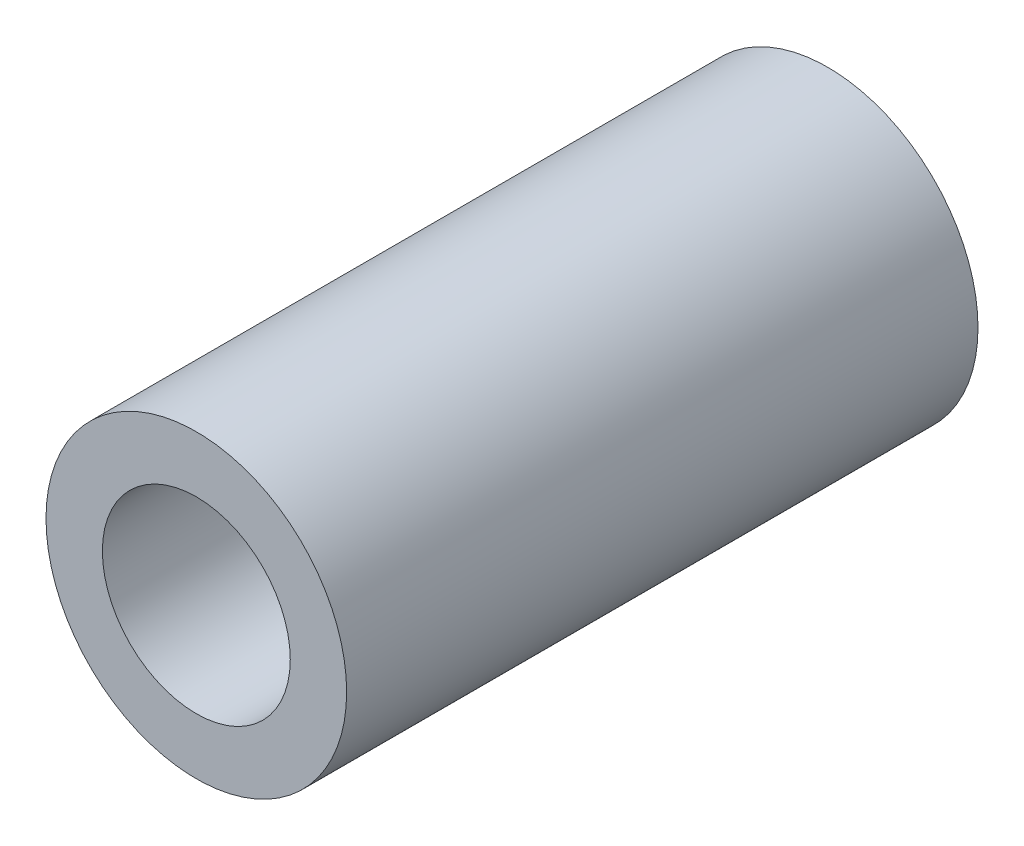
from build123d import *

# Parameters (mm, degrees)
ESQUISSE1_R      = 10
ESQUISSE1_R_2    = 6.25
EXTRUSION1_DEPTH = 42


with BuildPart() as part:
    # Esquisse1 → Extrusion1 (new body)
    with BuildSketch(Plane.XY):
        with Locations(Location((0, 0, 0), (0, 0, 180))):
            Circle(ESQUISSE1_R)
        with Locations(Location((0, 0, 0), (0, 0, 180))):
            Circle(ESQUISSE1_R_2, mode=Mode.SUBTRACT)
    extrude(amount=EXTRUSION1_DEPTH)


solid = part.part
